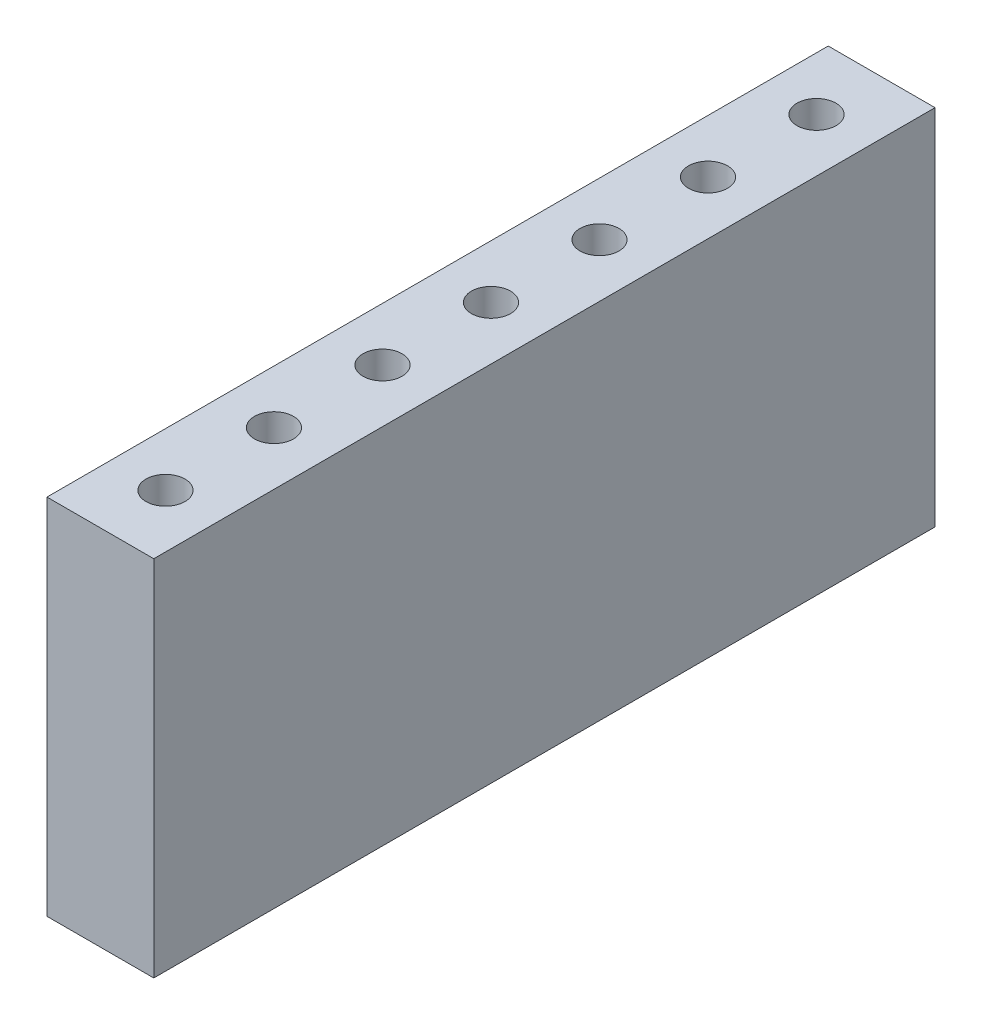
ISO-10303-21;
HEADER;
FILE_DESCRIPTION(('STEP AP214'),'2;1');
FILE_NAME('part.step','',(''),(''),'','','');
FILE_SCHEMA(('AUTOMOTIVE_DESIGN { 1 0 10303 214 1 1 1 1 }'));
ENDSEC;
DATA;
#1=APPLICATION_CONTEXT('core data for automotive mechanical design processes');
#2=APPLICATION_PROTOCOL_DEFINITION('international standard','automotive_design',2000,#1);
#3=PRODUCT_CONTEXT('',#1,'mechanical');
#4=PRODUCT('Part','Part','',(#3));
#5=PRODUCT_RELATED_PRODUCT_CATEGORY('part','',(#4));
#6=PRODUCT_DEFINITION_FORMATION('','',#4);
#7=PRODUCT_DEFINITION_CONTEXT('part definition',#1,'design');
#8=PRODUCT_DEFINITION('design','',#6,#7);
#9=PRODUCT_DEFINITION_SHAPE('','',#8);
#10=(LENGTH_UNIT() NAMED_UNIT(*) SI_UNIT(.MILLI.,.METRE.));
#11=(NAMED_UNIT(*) PLANE_ANGLE_UNIT() SI_UNIT($,.RADIAN.));
#12=(NAMED_UNIT(*) SI_UNIT($,.STERADIAN.) SOLID_ANGLE_UNIT());
#13=UNCERTAINTY_MEASURE_WITH_UNIT(LENGTH_MEASURE(1.E-05),#10,'distance_accuracy_value','');
#14=(GEOMETRIC_REPRESENTATION_CONTEXT(3) GLOBAL_UNCERTAINTY_ASSIGNED_CONTEXT((#13)) GLOBAL_UNIT_ASSIGNED_CONTEXT((#10,
#11,#12)) REPRESENTATION_CONTEXT('',''));
#15=CARTESIAN_POINT('',(0.,0.,0.));
#16=DIRECTION('',(0.,0.,1.));
#17=DIRECTION('',(1.,0.,0.));
#18=AXIS2_PLACEMENT_3D('',#15,#16,#17);
#19=CARTESIAN_POINT('',(0.,8.5,0.));
#20=DIRECTION('',(1.,0.,0.));
#21=DIRECTION('',(0.,0.,-1.));
#22=AXIS2_PLACEMENT_3D('',#19,#20,#21);
#23=PLANE('',#22);
#24=DIRECTION('',(0.,0.,1.));
#25=VECTOR('',#24,1.);
#26=CARTESIAN_POINT('',(0.,0.,0.));
#27=LINE('',#26,#25);
#28=CARTESIAN_POINT('',(0.,0.,-18.288));
#29=VERTEX_POINT('',#28);
#30=CARTESIAN_POINT('',(0.,0.,0.));
#31=VERTEX_POINT('',#30);
#32=EDGE_CURVE('E74',#29,#31,#27,.T.);
#33=ORIENTED_EDGE('',*,*,#32,.T.);
#34=DIRECTION('',(0.,-1.,0.));
#35=VECTOR('',#34,1.);
#36=CARTESIAN_POINT('',(0.,8.5,0.));
#37=LINE('',#36,#35);
#38=CARTESIAN_POINT('',(0.,8.5,0.));
#39=VERTEX_POINT('',#38);
#40=EDGE_CURVE('E11',#39,#31,#37,.T.);
#41=ORIENTED_EDGE('',*,*,#40,.F.);
#42=DIRECTION('',(0.,0.,1.));
#43=VECTOR('',#42,1.);
#44=CARTESIAN_POINT('',(0.,8.5,0.));
#45=LINE('',#44,#43);
#46=CARTESIAN_POINT('',(0.,8.5,-18.288));
#47=VERTEX_POINT('',#46);
#48=EDGE_CURVE('E97',#47,#39,#45,.T.);
#49=ORIENTED_EDGE('',*,*,#48,.F.);
#50=DIRECTION('',(0.,-1.,0.));
#51=VECTOR('',#50,1.);
#52=CARTESIAN_POINT('',(0.,8.5,-18.288));
#53=LINE('',#52,#51);
#54=EDGE_CURVE('E86',#47,#29,#53,.T.);
#55=ORIENTED_EDGE('',*,*,#54,.T.);
#56=EDGE_LOOP('',(#33,#41,#49,#55));
#57=FACE_BOUND('',#56,.T.);
#58=ADVANCED_FACE('F30',(#57),#23,.F.);
#59=CARTESIAN_POINT('',(0.,8.5,0.));
#60=DIRECTION('',(0.,0.,-1.));
#61=DIRECTION('',(-1.,0.,0.));
#62=AXIS2_PLACEMENT_3D('',#59,#60,#61);
#63=PLANE('',#62);
#64=DIRECTION('',(1.,0.,0.));
#65=VECTOR('',#64,1.);
#66=CARTESIAN_POINT('',(0.,0.,0.));
#67=LINE('',#66,#65);
#68=CARTESIAN_POINT('',(2.5,0.,0.));
#69=VERTEX_POINT('',#68);
#70=EDGE_CURVE('E70',#31,#69,#67,.T.);
#71=ORIENTED_EDGE('',*,*,#70,.T.);
#72=DIRECTION('',(0.,-1.,0.));
#73=VECTOR('',#72,1.);
#74=CARTESIAN_POINT('',(2.5,8.5,0.));
#75=LINE('',#74,#73);
#76=CARTESIAN_POINT('',(2.5,8.5,0.));
#77=VERTEX_POINT('',#76);
#78=EDGE_CURVE('E37',#77,#69,#75,.T.);
#79=ORIENTED_EDGE('',*,*,#78,.F.);
#80=DIRECTION('',(1.,0.,0.));
#81=VECTOR('',#80,1.);
#82=CARTESIAN_POINT('',(0.,8.5,0.));
#83=LINE('',#82,#81);
#84=EDGE_CURVE('E82',#39,#77,#83,.T.);
#85=ORIENTED_EDGE('',*,*,#84,.F.);
#86=ORIENTED_EDGE('',*,*,#40,.T.);
#87=EDGE_LOOP('',(#71,#79,#85,#86));
#88=FACE_BOUND('',#87,.T.);
#89=ADVANCED_FACE('F81',(#88),#63,.F.);
#90=CARTESIAN_POINT('',(2.5,8.5,0.));
#91=DIRECTION('',(-1.,0.,0.));
#92=DIRECTION('',(0.,0.,1.));
#93=AXIS2_PLACEMENT_3D('',#90,#91,#92);
#94=PLANE('',#93);
#95=DIRECTION('',(0.,0.,-1.));
#96=VECTOR('',#95,1.);
#97=CARTESIAN_POINT('',(2.5,0.,0.));
#98=LINE('',#97,#96);
#99=CARTESIAN_POINT('',(2.5,0.,-18.288));
#100=VERTEX_POINT('',#99);
#101=EDGE_CURVE('E75',#69,#100,#98,.T.);
#102=ORIENTED_EDGE('',*,*,#101,.T.);
#103=DIRECTION('',(0.,-1.,0.));
#104=VECTOR('',#103,1.);
#105=CARTESIAN_POINT('',(2.5,8.5,-18.288));
#106=LINE('',#105,#104);
#107=CARTESIAN_POINT('',(2.5,8.5,-18.288));
#108=VERTEX_POINT('',#107);
#109=EDGE_CURVE('E103',#108,#100,#106,.T.);
#110=ORIENTED_EDGE('',*,*,#109,.F.);
#111=DIRECTION('',(0.,0.,-1.));
#112=VECTOR('',#111,1.);
#113=CARTESIAN_POINT('',(2.5,8.5,0.));
#114=LINE('',#113,#112);
#115=EDGE_CURVE('E49',#77,#108,#114,.T.);
#116=ORIENTED_EDGE('',*,*,#115,.F.);
#117=ORIENTED_EDGE('',*,*,#78,.T.);
#118=EDGE_LOOP('',(#102,#110,#116,#117));
#119=FACE_BOUND('',#118,.T.);
#120=ADVANCED_FACE('F106',(#119),#94,.F.);
#121=CARTESIAN_POINT('',(0.,8.5,-18.288));
#122=DIRECTION('',(0.,0.,1.));
#123=DIRECTION('',(1.,0.,0.));
#124=AXIS2_PLACEMENT_3D('',#121,#122,#123);
#125=PLANE('',#124);
#126=DIRECTION('',(-1.,0.,0.));
#127=VECTOR('',#126,1.);
#128=CARTESIAN_POINT('',(0.,0.,-18.288));
#129=LINE('',#128,#127);
#130=EDGE_CURVE('E95',#100,#29,#129,.T.);
#131=ORIENTED_EDGE('',*,*,#130,.T.);
#132=ORIENTED_EDGE('',*,*,#54,.F.);
#133=DIRECTION('',(-1.,0.,0.));
#134=VECTOR('',#133,1.);
#135=CARTESIAN_POINT('',(0.,8.5,-18.288));
#136=LINE('',#135,#134);
#137=EDGE_CURVE('E44',#108,#47,#136,.T.);
#138=ORIENTED_EDGE('',*,*,#137,.F.);
#139=ORIENTED_EDGE('',*,*,#109,.T.);
#140=EDGE_LOOP('',(#131,#132,#138,#139));
#141=FACE_BOUND('',#140,.T.);
#142=ADVANCED_FACE('F108',(#141),#125,.F.);
#143=CARTESIAN_POINT('',(0.,8.5,-18.288));
#144=DIRECTION('',(0.,-1.,0.));
#145=DIRECTION('',(0.,0.,-1.));
#146=AXIS2_PLACEMENT_3D('',#143,#144,#145);
#147=PLANE('',#146);
#148=CARTESIAN_POINT('',(1.25,8.5,-16.764));
#149=DIRECTION('',(0.,1.,0.));
#150=DIRECTION('',(0.,0.,1.));
#151=AXIS2_PLACEMENT_3D('',#148,#149,#150);
#152=CIRCLE('',#151,0.457199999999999);
#153=CARTESIAN_POINT('',(1.25,8.5,-16.3068));
#154=VERTEX_POINT('',#153);
#155=EDGE_CURVE('E293',#154,#154,#152,.T.);
#156=ORIENTED_EDGE('',*,*,#155,.F.);
#157=EDGE_LOOP('',(#156));
#158=FACE_BOUND('',#157,.T.);
#159=CARTESIAN_POINT('',(1.25,8.5,-14.224));
#160=DIRECTION('',(0.,1.,0.));
#161=DIRECTION('',(0.,0.,1.));
#162=AXIS2_PLACEMENT_3D('',#159,#160,#161);
#163=CIRCLE('',#162,0.4572);
#164=CARTESIAN_POINT('',(1.25,8.5,-13.7668));
#165=VERTEX_POINT('',#164);
#166=EDGE_CURVE('E292',#165,#165,#163,.T.);
#167=ORIENTED_EDGE('',*,*,#166,.F.);
#168=EDGE_LOOP('',(#167));
#169=FACE_BOUND('',#168,.T.);
#170=CARTESIAN_POINT('',(1.25,8.5,-11.684));
#171=DIRECTION('',(0.,1.,0.));
#172=DIRECTION('',(0.,0.,1.));
#173=AXIS2_PLACEMENT_3D('',#170,#171,#172);
#174=CIRCLE('',#173,0.4572);
#175=CARTESIAN_POINT('',(1.25,8.5,-11.2268));
#176=VERTEX_POINT('',#175);
#177=EDGE_CURVE('E303',#176,#176,#174,.T.);
#178=ORIENTED_EDGE('',*,*,#177,.F.);
#179=EDGE_LOOP('',(#178));
#180=FACE_BOUND('',#179,.T.);
#181=CARTESIAN_POINT('',(1.25,8.5,-9.144));
#182=DIRECTION('',(0.,1.,0.));
#183=DIRECTION('',(0.,0.,1.));
#184=AXIS2_PLACEMENT_3D('',#181,#182,#183);
#185=CIRCLE('',#184,0.4572);
#186=CARTESIAN_POINT('',(1.25,8.5,-8.6868));
#187=VERTEX_POINT('',#186);
#188=EDGE_CURVE('E309',#187,#187,#185,.T.);
#189=ORIENTED_EDGE('',*,*,#188,.F.);
#190=EDGE_LOOP('',(#189));
#191=FACE_BOUND('',#190,.T.);
#192=CARTESIAN_POINT('',(1.25,8.5,-6.604));
#193=DIRECTION('',(0.,1.,0.));
#194=DIRECTION('',(0.,0.,1.));
#195=AXIS2_PLACEMENT_3D('',#192,#193,#194);
#196=CIRCLE('',#195,0.4572);
#197=CARTESIAN_POINT('',(1.25,8.5,-6.1468));
#198=VERTEX_POINT('',#197);
#199=EDGE_CURVE('E315',#198,#198,#196,.T.);
#200=ORIENTED_EDGE('',*,*,#199,.F.);
#201=EDGE_LOOP('',(#200));
#202=FACE_BOUND('',#201,.T.);
#203=CARTESIAN_POINT('',(1.25,8.5,-4.064));
#204=DIRECTION('',(0.,1.,0.));
#205=DIRECTION('',(0.,0.,1.));
#206=AXIS2_PLACEMENT_3D('',#203,#204,#205);
#207=CIRCLE('',#206,0.457200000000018);
#208=CARTESIAN_POINT('',(1.25,8.5,-3.60679999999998));
#209=VERTEX_POINT('',#208);
#210=EDGE_CURVE('E321',#209,#209,#207,.T.);
#211=ORIENTED_EDGE('',*,*,#210,.F.);
#212=EDGE_LOOP('',(#211));
#213=FACE_BOUND('',#212,.T.);
#214=CARTESIAN_POINT('',(1.25,8.5,-1.524));
#215=DIRECTION('',(0.,1.,0.));
#216=DIRECTION('',(0.,0.,1.));
#217=AXIS2_PLACEMENT_3D('',#214,#215,#216);
#218=CIRCLE('',#217,0.4572);
#219=CARTESIAN_POINT('',(1.25,8.5,-1.0668));
#220=VERTEX_POINT('',#219);
#221=EDGE_CURVE('E90',#220,#220,#218,.T.);
#222=ORIENTED_EDGE('',*,*,#221,.F.);
#223=EDGE_LOOP('',(#222));
#224=FACE_BOUND('',#223,.T.);
#225=ORIENTED_EDGE('',*,*,#48,.T.);
#226=ORIENTED_EDGE('',*,*,#84,.T.);
#227=ORIENTED_EDGE('',*,*,#115,.T.);
#228=ORIENTED_EDGE('',*,*,#137,.T.);
#229=EDGE_LOOP('',(#225,#226,#227,#228));
#230=FACE_BOUND('',#229,.T.);
#231=ADVANCED_FACE('F109',(#158,#169,#180,#191,#202,#213,#224,#230),#147,.F.);
#232=CARTESIAN_POINT('',(0.,0.,-18.288));
#233=DIRECTION('',(0.,-1.,0.));
#234=DIRECTION('',(0.,0.,-1.));
#235=AXIS2_PLACEMENT_3D('',#232,#233,#234);
#236=PLANE('',#235);
#237=ORIENTED_EDGE('',*,*,#32,.F.);
#238=ORIENTED_EDGE('',*,*,#130,.F.);
#239=ORIENTED_EDGE('',*,*,#101,.F.);
#240=ORIENTED_EDGE('',*,*,#70,.F.);
#241=EDGE_LOOP('',(#237,#238,#239,#240));
#242=FACE_BOUND('',#241,.T.);
#243=ADVANCED_FACE('F71',(#242),#236,.T.);
#244=CARTESIAN_POINT('',(1.25,2.12,-1.524));
#245=DIRECTION('',(0.,1.,0.));
#246=DIRECTION('',(0.,0.,1.));
#247=AXIS2_PLACEMENT_3D('',#244,#245,#246);
#248=CYLINDRICAL_SURFACE('',#247,0.4572);
#249=CARTESIAN_POINT('',(1.25,2.12,-1.524));
#250=DIRECTION('',(0.,1.,0.));
#251=DIRECTION('',(0.,0.,1.));
#252=AXIS2_PLACEMENT_3D('',#249,#250,#251);
#253=CIRCLE('',#252,0.4572);
#254=CARTESIAN_POINT('',(1.25,2.12,-1.0668));
#255=VERTEX_POINT('',#254);
#256=EDGE_CURVE('E87',#255,#255,#253,.T.);
#257=ORIENTED_EDGE('',*,*,#256,.F.);
#258=EDGE_LOOP('',(#257));
#259=FACE_BOUND('',#258,.T.);
#260=ORIENTED_EDGE('',*,*,#221,.T.);
#261=EDGE_LOOP('',(#260));
#262=FACE_BOUND('',#261,.T.);
#263=ADVANCED_FACE('F117',(#259,#262),#248,.F.);
#264=CARTESIAN_POINT('',(1.25,2.12,-1.524));
#265=DIRECTION('',(0.,1.,0.));
#266=DIRECTION('',(0.,0.,1.));
#267=AXIS2_PLACEMENT_3D('',#264,#265,#266);
#268=PLANE('',#267);
#269=ORIENTED_EDGE('',*,*,#256,.T.);
#270=EDGE_LOOP('',(#269));
#271=FACE_BOUND('',#270,.T.);
#272=ADVANCED_FACE('F155',(#271),#268,.T.);
#273=CARTESIAN_POINT('',(1.25,2.12,-4.064));
#274=DIRECTION('',(0.,1.,0.));
#275=DIRECTION('',(0.,0.,1.));
#276=AXIS2_PLACEMENT_3D('',#273,#274,#275);
#277=CYLINDRICAL_SURFACE('',#276,0.457200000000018);
#278=CARTESIAN_POINT('',(1.25,2.12,-4.064));
#279=DIRECTION('',(0.,1.,0.));
#280=DIRECTION('',(0.,0.,1.));
#281=AXIS2_PLACEMENT_3D('',#278,#279,#280);
#282=CIRCLE('',#281,0.457200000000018);
#283=CARTESIAN_POINT('',(1.25,2.12,-3.60679999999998));
#284=VERTEX_POINT('',#283);
#285=EDGE_CURVE('E324',#284,#284,#282,.T.);
#286=ORIENTED_EDGE('',*,*,#285,.F.);
#287=EDGE_LOOP('',(#286));
#288=FACE_BOUND('',#287,.T.);
#289=ORIENTED_EDGE('',*,*,#210,.T.);
#290=EDGE_LOOP('',(#289));
#291=FACE_BOUND('',#290,.T.);
#292=ADVANCED_FACE('F165',(#288,#291),#277,.F.);
#293=CARTESIAN_POINT('',(1.25,2.12,-4.064));
#294=DIRECTION('',(0.,1.,0.));
#295=DIRECTION('',(0.,0.,1.));
#296=AXIS2_PLACEMENT_3D('',#293,#294,#295);
#297=PLANE('',#296);
#298=ORIENTED_EDGE('',*,*,#285,.T.);
#299=EDGE_LOOP('',(#298));
#300=FACE_BOUND('',#299,.T.);
#301=ADVANCED_FACE('F175',(#300),#297,.T.);
#302=CARTESIAN_POINT('',(1.25,2.12,-6.604));
#303=DIRECTION('',(0.,1.,0.));
#304=DIRECTION('',(0.,0.,1.));
#305=AXIS2_PLACEMENT_3D('',#302,#303,#304);
#306=CYLINDRICAL_SURFACE('',#305,0.4572);
#307=CARTESIAN_POINT('',(1.25,2.12,-6.604));
#308=DIRECTION('',(0.,1.,0.));
#309=DIRECTION('',(0.,0.,1.));
#310=AXIS2_PLACEMENT_3D('',#307,#308,#309);
#311=CIRCLE('',#310,0.4572);
#312=CARTESIAN_POINT('',(1.25,2.12,-6.1468));
#313=VERTEX_POINT('',#312);
#314=EDGE_CURVE('E318',#313,#313,#311,.T.);
#315=ORIENTED_EDGE('',*,*,#314,.F.);
#316=EDGE_LOOP('',(#315));
#317=FACE_BOUND('',#316,.T.);
#318=ORIENTED_EDGE('',*,*,#199,.T.);
#319=EDGE_LOOP('',(#318));
#320=FACE_BOUND('',#319,.T.);
#321=ADVANCED_FACE('F185',(#317,#320),#306,.F.);
#322=CARTESIAN_POINT('',(1.25,2.12,-6.604));
#323=DIRECTION('',(0.,1.,0.));
#324=DIRECTION('',(0.,0.,1.));
#325=AXIS2_PLACEMENT_3D('',#322,#323,#324);
#326=PLANE('',#325);
#327=ORIENTED_EDGE('',*,*,#314,.T.);
#328=EDGE_LOOP('',(#327));
#329=FACE_BOUND('',#328,.T.);
#330=ADVANCED_FACE('F195',(#329),#326,.T.);
#331=CARTESIAN_POINT('',(1.25,2.12,-9.144));
#332=DIRECTION('',(0.,1.,0.));
#333=DIRECTION('',(0.,0.,1.));
#334=AXIS2_PLACEMENT_3D('',#331,#332,#333);
#335=CYLINDRICAL_SURFACE('',#334,0.4572);
#336=CARTESIAN_POINT('',(1.25,2.12,-9.144));
#337=DIRECTION('',(0.,1.,0.));
#338=DIRECTION('',(0.,0.,1.));
#339=AXIS2_PLACEMENT_3D('',#336,#337,#338);
#340=CIRCLE('',#339,0.4572);
#341=CARTESIAN_POINT('',(1.25,2.12,-8.6868));
#342=VERTEX_POINT('',#341);
#343=EDGE_CURVE('E312',#342,#342,#340,.T.);
#344=ORIENTED_EDGE('',*,*,#343,.F.);
#345=EDGE_LOOP('',(#344));
#346=FACE_BOUND('',#345,.T.);
#347=ORIENTED_EDGE('',*,*,#188,.T.);
#348=EDGE_LOOP('',(#347));
#349=FACE_BOUND('',#348,.T.);
#350=ADVANCED_FACE('F205',(#346,#349),#335,.F.);
#351=CARTESIAN_POINT('',(1.25,2.12,-9.144));
#352=DIRECTION('',(0.,1.,0.));
#353=DIRECTION('',(0.,0.,1.));
#354=AXIS2_PLACEMENT_3D('',#351,#352,#353);
#355=PLANE('',#354);
#356=ORIENTED_EDGE('',*,*,#343,.T.);
#357=EDGE_LOOP('',(#356));
#358=FACE_BOUND('',#357,.T.);
#359=ADVANCED_FACE('F215',(#358),#355,.T.);
#360=CARTESIAN_POINT('',(1.25,2.12,-11.684));
#361=DIRECTION('',(0.,1.,0.));
#362=DIRECTION('',(0.,0.,1.));
#363=AXIS2_PLACEMENT_3D('',#360,#361,#362);
#364=CYLINDRICAL_SURFACE('',#363,0.4572);
#365=CARTESIAN_POINT('',(1.25,2.12,-11.684));
#366=DIRECTION('',(0.,1.,0.));
#367=DIRECTION('',(0.,0.,1.));
#368=AXIS2_PLACEMENT_3D('',#365,#366,#367);
#369=CIRCLE('',#368,0.4572);
#370=CARTESIAN_POINT('',(1.25,2.12,-11.2268));
#371=VERTEX_POINT('',#370);
#372=EDGE_CURVE('E306',#371,#371,#369,.T.);
#373=ORIENTED_EDGE('',*,*,#372,.F.);
#374=EDGE_LOOP('',(#373));
#375=FACE_BOUND('',#374,.T.);
#376=ORIENTED_EDGE('',*,*,#177,.T.);
#377=EDGE_LOOP('',(#376));
#378=FACE_BOUND('',#377,.T.);
#379=ADVANCED_FACE('F225',(#375,#378),#364,.F.);
#380=CARTESIAN_POINT('',(1.25,2.12,-11.684));
#381=DIRECTION('',(0.,1.,0.));
#382=DIRECTION('',(0.,0.,1.));
#383=AXIS2_PLACEMENT_3D('',#380,#381,#382);
#384=PLANE('',#383);
#385=ORIENTED_EDGE('',*,*,#372,.T.);
#386=EDGE_LOOP('',(#385));
#387=FACE_BOUND('',#386,.T.);
#388=ADVANCED_FACE('F235',(#387),#384,.T.);
#389=CARTESIAN_POINT('',(1.25,2.12,-14.224));
#390=DIRECTION('',(0.,1.,0.));
#391=DIRECTION('',(0.,0.,1.));
#392=AXIS2_PLACEMENT_3D('',#389,#390,#391);
#393=CYLINDRICAL_SURFACE('',#392,0.4572);
#394=CARTESIAN_POINT('',(1.25,2.12,-14.224));
#395=DIRECTION('',(0.,1.,0.));
#396=DIRECTION('',(0.,0.,1.));
#397=AXIS2_PLACEMENT_3D('',#394,#395,#396);
#398=CIRCLE('',#397,0.4572);
#399=CARTESIAN_POINT('',(1.25,2.12,-13.7668));
#400=VERTEX_POINT('',#399);
#401=EDGE_CURVE('E296',#400,#400,#398,.T.);
#402=ORIENTED_EDGE('',*,*,#401,.F.);
#403=EDGE_LOOP('',(#402));
#404=FACE_BOUND('',#403,.T.);
#405=ORIENTED_EDGE('',*,*,#166,.T.);
#406=EDGE_LOOP('',(#405));
#407=FACE_BOUND('',#406,.T.);
#408=ADVANCED_FACE('F245',(#404,#407),#393,.F.);
#409=CARTESIAN_POINT('',(1.25,2.12,-14.224));
#410=DIRECTION('',(0.,1.,0.));
#411=DIRECTION('',(0.,0.,1.));
#412=AXIS2_PLACEMENT_3D('',#409,#410,#411);
#413=PLANE('',#412);
#414=ORIENTED_EDGE('',*,*,#401,.T.);
#415=EDGE_LOOP('',(#414));
#416=FACE_BOUND('',#415,.T.);
#417=ADVANCED_FACE('F255',(#416),#413,.T.);
#418=CARTESIAN_POINT('',(1.25,2.12,-16.764));
#419=DIRECTION('',(0.,1.,0.));
#420=DIRECTION('',(0.,0.,1.));
#421=AXIS2_PLACEMENT_3D('',#418,#419,#420);
#422=CYLINDRICAL_SURFACE('',#421,0.457199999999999);
#423=CARTESIAN_POINT('',(1.25,2.12,-16.764));
#424=DIRECTION('',(0.,1.,0.));
#425=DIRECTION('',(0.,0.,1.));
#426=AXIS2_PLACEMENT_3D('',#423,#424,#425);
#427=CIRCLE('',#426,0.457199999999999);
#428=CARTESIAN_POINT('',(1.25,2.12,-16.3068));
#429=VERTEX_POINT('',#428);
#430=EDGE_CURVE('E291',#429,#429,#427,.T.);
#431=ORIENTED_EDGE('',*,*,#430,.F.);
#432=EDGE_LOOP('',(#431));
#433=FACE_BOUND('',#432,.T.);
#434=ORIENTED_EDGE('',*,*,#155,.T.);
#435=EDGE_LOOP('',(#434));
#436=FACE_BOUND('',#435,.T.);
#437=ADVANCED_FACE('F265',(#433,#436),#422,.F.);
#438=CARTESIAN_POINT('',(1.25,2.12,-16.764));
#439=DIRECTION('',(0.,1.,0.));
#440=DIRECTION('',(0.,0.,1.));
#441=AXIS2_PLACEMENT_3D('',#438,#439,#440);
#442=PLANE('',#441);
#443=ORIENTED_EDGE('',*,*,#430,.T.);
#444=EDGE_LOOP('',(#443));
#445=FACE_BOUND('',#444,.T.);
#446=ADVANCED_FACE('F275',(#445),#442,.T.);
#447=CLOSED_SHELL('',(#58,#89,#120,#142,#231,#243,#263,#272,#292,#301,#321,#330,#350,#359,#379,
#388,#408,#417,#437,#446));
#448=MANIFOLD_SOLID_BREP('B2',#447);
#449=ADVANCED_BREP_SHAPE_REPRESENTATION('',(#18,#448),#14);
#450=SHAPE_DEFINITION_REPRESENTATION(#9,#449);
ENDSEC;
END-ISO-10303-21;
